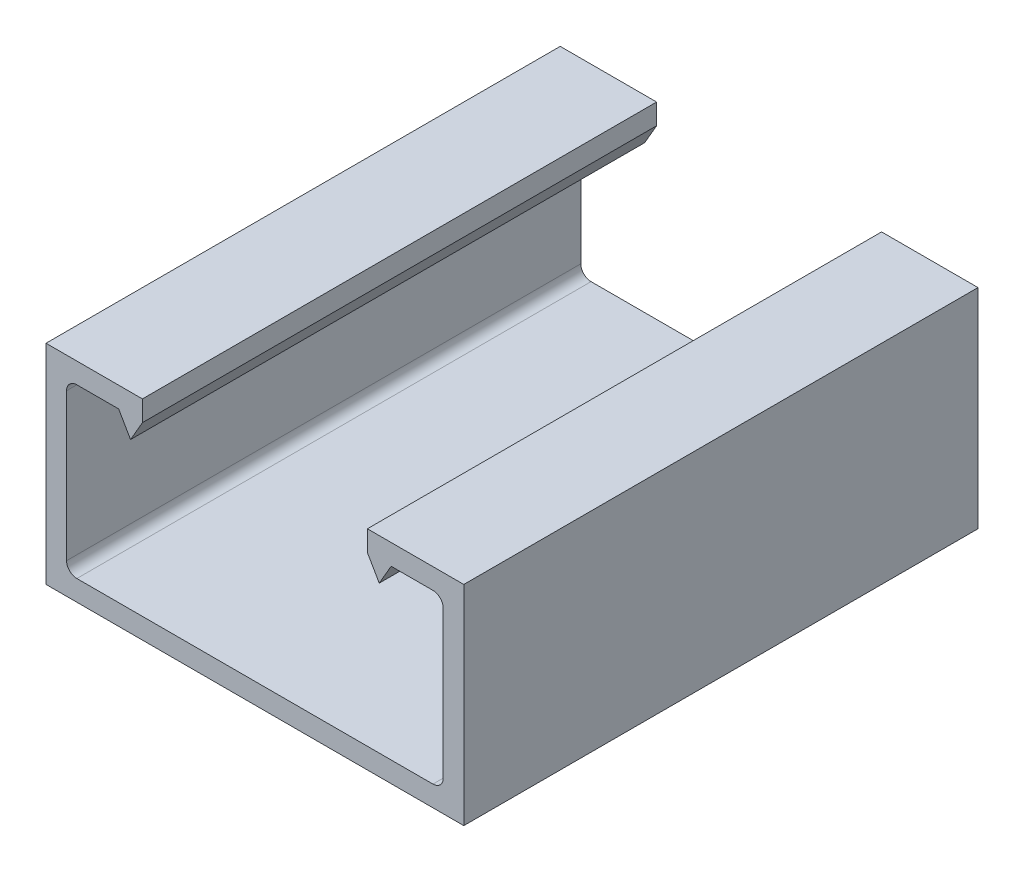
ISO-10303-21;
HEADER;
FILE_DESCRIPTION(('STEP AP214'),'2;1');
FILE_NAME('part.step','',(''),(''),'','','');
FILE_SCHEMA(('AUTOMOTIVE_DESIGN { 1 0 10303 214 1 1 1 1 }'));
ENDSEC;
DATA;
#1=APPLICATION_CONTEXT('core data for automotive mechanical design processes');
#2=APPLICATION_PROTOCOL_DEFINITION('international standard','automotive_design',2000,#1);
#3=PRODUCT_CONTEXT('',#1,'mechanical');
#4=PRODUCT('Part','Part','',(#3));
#5=PRODUCT_RELATED_PRODUCT_CATEGORY('part','',(#4));
#6=PRODUCT_DEFINITION_FORMATION('','',#4);
#7=PRODUCT_DEFINITION_CONTEXT('part definition',#1,'design');
#8=PRODUCT_DEFINITION('design','',#6,#7);
#9=PRODUCT_DEFINITION_SHAPE('','',#8);
#10=(LENGTH_UNIT() NAMED_UNIT(*) SI_UNIT(.MILLI.,.METRE.));
#11=(NAMED_UNIT(*) PLANE_ANGLE_UNIT() SI_UNIT($,.RADIAN.));
#12=(NAMED_UNIT(*) SI_UNIT($,.STERADIAN.) SOLID_ANGLE_UNIT());
#13=UNCERTAINTY_MEASURE_WITH_UNIT(LENGTH_MEASURE(1.E-05),#10,'distance_accuracy_value','');
#14=(GEOMETRIC_REPRESENTATION_CONTEXT(3) GLOBAL_UNCERTAINTY_ASSIGNED_CONTEXT((#13)) GLOBAL_UNIT_ASSIGNED_CONTEXT((#10,
#11,#12)) REPRESENTATION_CONTEXT('',''));
#15=CARTESIAN_POINT('',(0.,0.,0.));
#16=DIRECTION('',(0.,0.,1.));
#17=DIRECTION('',(1.,0.,0.));
#18=AXIS2_PLACEMENT_3D('',#15,#16,#17);
#19=CARTESIAN_POINT('',(-8.79475,-3.635375,12.7));
#20=DIRECTION('',(0.,0.,-1.));
#21=DIRECTION('',(-1.,0.,0.));
#22=AXIS2_PLACEMENT_3D('',#19,#20,#21);
#23=CYLINDRICAL_SURFACE('',#22,0.508);
#24=CARTESIAN_POINT('',(-8.79475,-3.635375,-12.7));
#25=DIRECTION('',(0.,0.,-1.));
#26=DIRECTION('',(1.,0.,0.));
#27=AXIS2_PLACEMENT_3D('',#24,#25,#26);
#28=CIRCLE('',#27,0.508);
#29=CARTESIAN_POINT('',(-8.79475,-4.143375,-12.7));
#30=VERTEX_POINT('',#29);
#31=CARTESIAN_POINT('',(-9.30275,-3.635375,-12.7));
#32=VERTEX_POINT('',#31);
#33=EDGE_CURVE('E210',#30,#32,#28,.T.);
#34=ORIENTED_EDGE('',*,*,#33,.T.);
#35=DIRECTION('',(0.,0.,-1.));
#36=VECTOR('',#35,1.);
#37=CARTESIAN_POINT('',(-9.30275,-3.635375,12.7));
#38=LINE('',#37,#36);
#39=CARTESIAN_POINT('',(-9.30275,-3.635375,12.7));
#40=VERTEX_POINT('',#39);
#41=EDGE_CURVE('E11',#40,#32,#38,.T.);
#42=ORIENTED_EDGE('',*,*,#41,.F.);
#43=CARTESIAN_POINT('',(-8.79475,-3.635375,12.7));
#44=DIRECTION('',(0.,0.,-1.));
#45=DIRECTION('',(1.,0.,0.));
#46=AXIS2_PLACEMENT_3D('',#43,#44,#45);
#47=CIRCLE('',#46,0.508);
#48=CARTESIAN_POINT('',(-8.79475,-4.143375,12.7));
#49=VERTEX_POINT('',#48);
#50=EDGE_CURVE('E244',#49,#40,#47,.T.);
#51=ORIENTED_EDGE('',*,*,#50,.F.);
#52=DIRECTION('',(0.,0.,-1.));
#53=VECTOR('',#52,1.);
#54=CARTESIAN_POINT('',(-8.79475,-4.143375,12.7));
#55=LINE('',#54,#53);
#56=EDGE_CURVE('E205',#49,#30,#55,.T.);
#57=ORIENTED_EDGE('',*,*,#56,.T.);
#58=EDGE_LOOP('',(#34,#42,#51,#57));
#59=FACE_BOUND('',#58,.T.);
#60=ADVANCED_FACE('F39',(#59),#23,.F.);
#61=CARTESIAN_POINT('',(-9.30275,3.635375,12.7));
#62=DIRECTION('',(-1.,0.,0.));
#63=DIRECTION('',(0.,-1.,0.));
#64=AXIS2_PLACEMENT_3D('',#61,#62,#63);
#65=PLANE('',#64);
#66=DIRECTION('',(0.,1.,0.));
#67=VECTOR('',#66,1.);
#68=CARTESIAN_POINT('',(-9.30275,3.635375,-12.7));
#69=LINE('',#68,#67);
#70=CARTESIAN_POINT('',(-9.30275,3.635375,-12.7));
#71=VERTEX_POINT('',#70);
#72=EDGE_CURVE('E208',#32,#71,#69,.T.);
#73=ORIENTED_EDGE('',*,*,#72,.T.);
#74=DIRECTION('',(0.,0.,-1.));
#75=VECTOR('',#74,1.);
#76=CARTESIAN_POINT('',(-9.30275,3.635375,12.7));
#77=LINE('',#76,#75);
#78=CARTESIAN_POINT('',(-9.30275,3.635375,12.7));
#79=VERTEX_POINT('',#78);
#80=EDGE_CURVE('E50',#79,#71,#77,.T.);
#81=ORIENTED_EDGE('',*,*,#80,.F.);
#82=DIRECTION('',(0.,1.,0.));
#83=VECTOR('',#82,1.);
#84=CARTESIAN_POINT('',(-9.30275,3.635375,12.7));
#85=LINE('',#84,#83);
#86=EDGE_CURVE('E135',#40,#79,#85,.T.);
#87=ORIENTED_EDGE('',*,*,#86,.F.);
#88=ORIENTED_EDGE('',*,*,#41,.T.);
#89=EDGE_LOOP('',(#73,#81,#87,#88));
#90=FACE_BOUND('',#89,.T.);
#91=ADVANCED_FACE('F361',(#90),#65,.F.);
#92=CARTESIAN_POINT('',(-8.79475,3.635375,12.7));
#93=DIRECTION('',(0.,0.,-1.));
#94=DIRECTION('',(-1.,0.,0.));
#95=AXIS2_PLACEMENT_3D('',#92,#93,#94);
#96=CYLINDRICAL_SURFACE('',#95,0.508000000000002);
#97=CARTESIAN_POINT('',(-8.79475,3.635375,-12.7));
#98=DIRECTION('',(0.,0.,-1.));
#99=DIRECTION('',(1.,0.,0.));
#100=AXIS2_PLACEMENT_3D('',#97,#98,#99);
#101=CIRCLE('',#100,0.508000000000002);
#102=CARTESIAN_POINT('',(-8.79475,4.143375,-12.7));
#103=VERTEX_POINT('',#102);
#104=EDGE_CURVE('E215',#71,#103,#101,.T.);
#105=ORIENTED_EDGE('',*,*,#104,.T.);
#106=DIRECTION('',(0.,0.,-1.));
#107=VECTOR('',#106,1.);
#108=CARTESIAN_POINT('',(-8.79475,4.143375,12.7));
#109=LINE('',#108,#107);
#110=CARTESIAN_POINT('',(-8.79475,4.143375,12.7));
#111=VERTEX_POINT('',#110);
#112=EDGE_CURVE('E290',#111,#103,#109,.T.);
#113=ORIENTED_EDGE('',*,*,#112,.F.);
#114=CARTESIAN_POINT('',(-8.79475,3.635375,12.7));
#115=DIRECTION('',(0.,0.,-1.));
#116=DIRECTION('',(1.,0.,0.));
#117=AXIS2_PLACEMENT_3D('',#114,#115,#116);
#118=CIRCLE('',#117,0.508000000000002);
#119=EDGE_CURVE('E298',#79,#111,#118,.T.);
#120=ORIENTED_EDGE('',*,*,#119,.F.);
#121=ORIENTED_EDGE('',*,*,#80,.T.);
#122=EDGE_LOOP('',(#105,#113,#120,#121));
#123=FACE_BOUND('',#122,.T.);
#124=ADVANCED_FACE('F295',(#123),#96,.F.);
#125=CARTESIAN_POINT('',(-6.72942574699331,4.143375,12.7));
#126=DIRECTION('',(0.,1.,0.));
#127=DIRECTION('',(0.,0.,1.));
#128=AXIS2_PLACEMENT_3D('',#125,#126,#127);
#129=PLANE('',#128);
#130=DIRECTION('',(1.,0.,0.));
#131=VECTOR('',#130,1.);
#132=CARTESIAN_POINT('',(-6.72942574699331,4.143375,-12.7));
#133=LINE('',#132,#131);
#134=CARTESIAN_POINT('',(-6.72942574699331,4.143375,-12.7));
#135=VERTEX_POINT('',#134);
#136=EDGE_CURVE('E211',#103,#135,#133,.T.);
#137=ORIENTED_EDGE('',*,*,#136,.T.);
#138=DIRECTION('',(0.,0.,-1.));
#139=VECTOR('',#138,1.);
#140=CARTESIAN_POINT('',(-6.72942574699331,4.143375,12.7));
#141=LINE('',#140,#139);
#142=CARTESIAN_POINT('',(-6.72942574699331,4.143375,12.7));
#143=VERTEX_POINT('',#142);
#144=EDGE_CURVE('E281',#143,#135,#141,.T.);
#145=ORIENTED_EDGE('',*,*,#144,.F.);
#146=DIRECTION('',(1.,0.,0.));
#147=VECTOR('',#146,1.);
#148=CARTESIAN_POINT('',(-6.72942574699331,4.143375,12.7));
#149=LINE('',#148,#147);
#150=EDGE_CURVE('E313',#111,#143,#149,.T.);
#151=ORIENTED_EDGE('',*,*,#150,.F.);
#152=ORIENTED_EDGE('',*,*,#112,.T.);
#153=EDGE_LOOP('',(#137,#145,#151,#152));
#154=FACE_BOUND('',#153,.T.);
#155=ADVANCED_FACE('F304',(#154),#129,.F.);
#156=CARTESIAN_POINT('',(-6.72942574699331,4.143375,12.7));
#157=DIRECTION('',(0.866025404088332,0.499999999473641,0.));
#158=DIRECTION('',(-0.499999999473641,0.866025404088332,0.));
#159=AXIS2_PLACEMENT_3D('',#156,#157,#158);
#160=PLANE('',#159);
#161=DIRECTION('',(0.499999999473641,-0.866025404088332,0.));
#162=VECTOR('',#161,1.);
#163=CARTESIAN_POINT('',(-6.72942574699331,4.143375,-12.7));
#164=LINE('',#163,#162);
#165=CARTESIAN_POINT('',(-6.14283787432,3.127375,-12.7));
#166=VERTEX_POINT('',#165);
#167=EDGE_CURVE('E218',#135,#166,#164,.T.);
#168=ORIENTED_EDGE('',*,*,#167,.T.);
#169=DIRECTION('',(0.,0.,-1.));
#170=VECTOR('',#169,1.);
#171=CARTESIAN_POINT('',(-6.14283787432,3.127375,12.7));
#172=LINE('',#171,#170);
#173=CARTESIAN_POINT('',(-6.14283787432,3.127375,12.7));
#174=VERTEX_POINT('',#173);
#175=EDGE_CURVE('E284',#174,#166,#172,.T.);
#176=ORIENTED_EDGE('',*,*,#175,.F.);
#177=DIRECTION('',(0.499999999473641,-0.866025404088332,0.));
#178=VECTOR('',#177,1.);
#179=CARTESIAN_POINT('',(-6.72942574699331,4.143375,12.7));
#180=LINE('',#179,#178);
#181=EDGE_CURVE('E311',#143,#174,#180,.T.);
#182=ORIENTED_EDGE('',*,*,#181,.F.);
#183=ORIENTED_EDGE('',*,*,#144,.T.);
#184=EDGE_LOOP('',(#168,#176,#182,#183));
#185=FACE_BOUND('',#184,.T.);
#186=ADVANCED_FACE('F307',(#185),#160,.F.);
#187=CARTESIAN_POINT('',(-6.14283787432,3.127375,12.7));
#188=DIRECTION('',(-0.866025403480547,0.500000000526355,0.));
#189=DIRECTION('',(-0.500000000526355,-0.866025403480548,0.));
#190=AXIS2_PLACEMENT_3D('',#187,#188,#189);
#191=PLANE('',#190);
#192=DIRECTION('',(0.500000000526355,0.866025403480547,0.));
#193=VECTOR('',#192,1.);
#194=CARTESIAN_POINT('',(-6.14283787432,3.127375,-12.7));
#195=LINE('',#194,#193);
#196=CARTESIAN_POINT('',(-5.55625,4.143375,-12.7));
#197=VERTEX_POINT('',#196);
#198=EDGE_CURVE('E217',#166,#197,#195,.T.);
#199=ORIENTED_EDGE('',*,*,#198,.T.);
#200=DIRECTION('',(0.,0.,-1.));
#201=VECTOR('',#200,1.);
#202=CARTESIAN_POINT('',(-5.55625,4.143375,12.7));
#203=LINE('',#202,#201);
#204=CARTESIAN_POINT('',(-5.55625,4.143375,12.7));
#205=VERTEX_POINT('',#204);
#206=EDGE_CURVE('E276',#205,#197,#203,.T.);
#207=ORIENTED_EDGE('',*,*,#206,.F.);
#208=DIRECTION('',(0.500000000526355,0.866025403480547,0.));
#209=VECTOR('',#208,1.);
#210=CARTESIAN_POINT('',(-6.14283787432,3.127375,12.7));
#211=LINE('',#210,#209);
#212=EDGE_CURVE('E312',#174,#205,#211,.T.);
#213=ORIENTED_EDGE('',*,*,#212,.F.);
#214=ORIENTED_EDGE('',*,*,#175,.T.);
#215=EDGE_LOOP('',(#199,#207,#213,#214));
#216=FACE_BOUND('',#215,.T.);
#217=ADVANCED_FACE('F376',(#216),#191,.F.);
#218=CARTESIAN_POINT('',(-5.55625,4.143375,12.7));
#219=DIRECTION('',(-1.,0.,0.));
#220=DIRECTION('',(0.,0.,1.));
#221=AXIS2_PLACEMENT_3D('',#218,#219,#220);
#222=PLANE('',#221);
#223=DIRECTION('',(0.,1.,0.));
#224=VECTOR('',#223,1.);
#225=CARTESIAN_POINT('',(-5.55625,4.143375,-12.7));
#226=LINE('',#225,#224);
#227=CARTESIAN_POINT('',(-5.55625,5.159375,-12.7));
#228=VERTEX_POINT('',#227);
#229=EDGE_CURVE('E216',#197,#228,#226,.T.);
#230=ORIENTED_EDGE('',*,*,#229,.T.);
#231=DIRECTION('',(0.,0.,-1.));
#232=VECTOR('',#231,1.);
#233=CARTESIAN_POINT('',(-5.55625,5.159375,12.7));
#234=LINE('',#233,#232);
#235=CARTESIAN_POINT('',(-5.55625,5.159375,12.7));
#236=VERTEX_POINT('',#235);
#237=EDGE_CURVE('E277',#236,#228,#234,.T.);
#238=ORIENTED_EDGE('',*,*,#237,.F.);
#239=DIRECTION('',(0.,1.,0.));
#240=VECTOR('',#239,1.);
#241=CARTESIAN_POINT('',(-5.55625,4.143375,12.7));
#242=LINE('',#241,#240);
#243=EDGE_CURVE('E317',#205,#236,#242,.T.);
#244=ORIENTED_EDGE('',*,*,#243,.F.);
#245=ORIENTED_EDGE('',*,*,#206,.T.);
#246=EDGE_LOOP('',(#230,#238,#244,#245));
#247=FACE_BOUND('',#246,.T.);
#248=ADVANCED_FACE('F378',(#247),#222,.F.);
#249=CARTESIAN_POINT('',(-5.55625,5.159375,12.7));
#250=DIRECTION('',(0.,-1.,0.));
#251=DIRECTION('',(1.,0.,0.));
#252=AXIS2_PLACEMENT_3D('',#249,#250,#251);
#253=PLANE('',#252);
#254=DIRECTION('',(-1.,0.,0.));
#255=VECTOR('',#254,1.);
#256=CARTESIAN_POINT('',(-5.55625,5.159375,-12.7));
#257=LINE('',#256,#255);
#258=CARTESIAN_POINT('',(-10.31875,5.159375,-12.7));
#259=VERTEX_POINT('',#258);
#260=EDGE_CURVE('E224',#228,#259,#257,.T.);
#261=ORIENTED_EDGE('',*,*,#260,.T.);
#262=DIRECTION('',(0.,0.,-1.));
#263=VECTOR('',#262,1.);
#264=CARTESIAN_POINT('',(-10.31875,5.159375,12.7));
#265=LINE('',#264,#263);
#266=CARTESIAN_POINT('',(-10.31875,5.159375,12.7));
#267=VERTEX_POINT('',#266);
#268=EDGE_CURVE('E271',#267,#259,#265,.T.);
#269=ORIENTED_EDGE('',*,*,#268,.F.);
#270=DIRECTION('',(-1.,0.,0.));
#271=VECTOR('',#270,1.);
#272=CARTESIAN_POINT('',(-5.55625,5.159375,12.7));
#273=LINE('',#272,#271);
#274=EDGE_CURVE('E325',#236,#267,#273,.T.);
#275=ORIENTED_EDGE('',*,*,#274,.F.);
#276=ORIENTED_EDGE('',*,*,#237,.T.);
#277=EDGE_LOOP('',(#261,#269,#275,#276));
#278=FACE_BOUND('',#277,.T.);
#279=ADVANCED_FACE('F384',(#278),#253,.F.);
#280=CARTESIAN_POINT('',(-10.31875,5.159375,12.7));
#281=DIRECTION('',(1.,0.,0.));
#282=DIRECTION('',(0.,0.,-1.));
#283=AXIS2_PLACEMENT_3D('',#280,#281,#282);
#284=PLANE('',#283);
#285=DIRECTION('',(0.,-1.,0.));
#286=VECTOR('',#285,1.);
#287=CARTESIAN_POINT('',(-10.31875,5.159375,-12.7));
#288=LINE('',#287,#286);
#289=CARTESIAN_POINT('',(-10.31875,-5.159375,-12.7));
#290=VERTEX_POINT('',#289);
#291=EDGE_CURVE('E221',#259,#290,#288,.T.);
#292=ORIENTED_EDGE('',*,*,#291,.T.);
#293=DIRECTION('',(0.,0.,-1.));
#294=VECTOR('',#293,1.);
#295=CARTESIAN_POINT('',(-10.31875,-5.159375,12.7));
#296=LINE('',#295,#294);
#297=CARTESIAN_POINT('',(-10.31875,-5.159375,12.7));
#298=VERTEX_POINT('',#297);
#299=EDGE_CURVE('E268',#298,#290,#296,.T.);
#300=ORIENTED_EDGE('',*,*,#299,.F.);
#301=DIRECTION('',(0.,-1.,0.));
#302=VECTOR('',#301,1.);
#303=CARTESIAN_POINT('',(-10.31875,5.159375,12.7));
#304=LINE('',#303,#302);
#305=EDGE_CURVE('E321',#267,#298,#304,.T.);
#306=ORIENTED_EDGE('',*,*,#305,.F.);
#307=ORIENTED_EDGE('',*,*,#268,.T.);
#308=EDGE_LOOP('',(#292,#300,#306,#307));
#309=FACE_BOUND('',#308,.T.);
#310=ADVANCED_FACE('F390',(#309),#284,.F.);
#311=CARTESIAN_POINT('',(-10.31875,-5.159375,12.7));
#312=DIRECTION('',(0.,1.,0.));
#313=DIRECTION('',(0.,0.,1.));
#314=AXIS2_PLACEMENT_3D('',#311,#312,#313);
#315=PLANE('',#314);
#316=DIRECTION('',(1.,0.,0.));
#317=VECTOR('',#316,1.);
#318=CARTESIAN_POINT('',(-10.31875,-5.159375,-12.7));
#319=LINE('',#318,#317);
#320=CARTESIAN_POINT('',(10.31875,-5.159375,-12.7));
#321=VERTEX_POINT('',#320);
#322=EDGE_CURVE('E228',#290,#321,#319,.T.);
#323=ORIENTED_EDGE('',*,*,#322,.T.);
#324=DIRECTION('',(0.,0.,-1.));
#325=VECTOR('',#324,1.);
#326=CARTESIAN_POINT('',(10.31875,-5.159375,12.7));
#327=LINE('',#326,#325);
#328=CARTESIAN_POINT('',(10.31875,-5.159375,12.7));
#329=VERTEX_POINT('',#328);
#330=EDGE_CURVE('E269',#329,#321,#327,.T.);
#331=ORIENTED_EDGE('',*,*,#330,.F.);
#332=DIRECTION('',(1.,0.,0.));
#333=VECTOR('',#332,1.);
#334=CARTESIAN_POINT('',(-10.31875,-5.159375,12.7));
#335=LINE('',#334,#333);
#336=EDGE_CURVE('E328',#298,#329,#335,.T.);
#337=ORIENTED_EDGE('',*,*,#336,.F.);
#338=ORIENTED_EDGE('',*,*,#299,.T.);
#339=EDGE_LOOP('',(#323,#331,#337,#338));
#340=FACE_BOUND('',#339,.T.);
#341=ADVANCED_FACE('F393',(#340),#315,.F.);
#342=CARTESIAN_POINT('',(10.31875,-5.159375,12.7));
#343=DIRECTION('',(-1.,0.,0.));
#344=DIRECTION('',(0.,-1.,0.));
#345=AXIS2_PLACEMENT_3D('',#342,#343,#344);
#346=PLANE('',#345);
#347=DIRECTION('',(0.,1.,0.));
#348=VECTOR('',#347,1.);
#349=CARTESIAN_POINT('',(10.31875,-5.159375,-12.7));
#350=LINE('',#349,#348);
#351=CARTESIAN_POINT('',(10.31875,5.159375,-12.7));
#352=VERTEX_POINT('',#351);
#353=EDGE_CURVE('E226',#321,#352,#350,.T.);
#354=ORIENTED_EDGE('',*,*,#353,.T.);
#355=DIRECTION('',(0.,0.,-1.));
#356=VECTOR('',#355,1.);
#357=CARTESIAN_POINT('',(10.31875,5.159375,12.7));
#358=LINE('',#357,#356);
#359=CARTESIAN_POINT('',(10.31875,5.159375,12.7));
#360=VERTEX_POINT('',#359);
#361=EDGE_CURVE('E265',#360,#352,#358,.T.);
#362=ORIENTED_EDGE('',*,*,#361,.F.);
#363=DIRECTION('',(0.,1.,0.));
#364=VECTOR('',#363,1.);
#365=CARTESIAN_POINT('',(10.31875,-5.159375,12.7));
#366=LINE('',#365,#364);
#367=EDGE_CURVE('E327',#329,#360,#366,.T.);
#368=ORIENTED_EDGE('',*,*,#367,.F.);
#369=ORIENTED_EDGE('',*,*,#330,.T.);
#370=EDGE_LOOP('',(#354,#362,#368,#369));
#371=FACE_BOUND('',#370,.T.);
#372=ADVANCED_FACE('F391',(#371),#346,.F.);
#373=CARTESIAN_POINT('',(10.31875,5.159375,12.7));
#374=DIRECTION('',(0.,-1.,0.));
#375=DIRECTION('',(1.,0.,0.));
#376=AXIS2_PLACEMENT_3D('',#373,#374,#375);
#377=PLANE('',#376);
#378=DIRECTION('',(-1.,0.,0.));
#379=VECTOR('',#378,1.);
#380=CARTESIAN_POINT('',(10.31875,5.159375,-12.7));
#381=LINE('',#380,#379);
#382=CARTESIAN_POINT('',(5.55625,5.159375,-12.7));
#383=VERTEX_POINT('',#382);
#384=EDGE_CURVE('E229',#352,#383,#381,.T.);
#385=ORIENTED_EDGE('',*,*,#384,.T.);
#386=DIRECTION('',(0.,0.,-1.));
#387=VECTOR('',#386,1.);
#388=CARTESIAN_POINT('',(5.55625,5.159375,12.7));
#389=LINE('',#388,#387);
#390=CARTESIAN_POINT('',(5.55625,5.159375,12.7));
#391=VERTEX_POINT('',#390);
#392=EDGE_CURVE('E263',#391,#383,#389,.T.);
#393=ORIENTED_EDGE('',*,*,#392,.F.);
#394=DIRECTION('',(-1.,0.,0.));
#395=VECTOR('',#394,1.);
#396=CARTESIAN_POINT('',(10.31875,5.159375,12.7));
#397=LINE('',#396,#395);
#398=EDGE_CURVE('E326',#360,#391,#397,.T.);
#399=ORIENTED_EDGE('',*,*,#398,.F.);
#400=ORIENTED_EDGE('',*,*,#361,.T.);
#401=EDGE_LOOP('',(#385,#393,#399,#400));
#402=FACE_BOUND('',#401,.T.);
#403=ADVANCED_FACE('F396',(#402),#377,.F.);
#404=CARTESIAN_POINT('',(5.55625,4.143375,12.7));
#405=DIRECTION('',(1.,0.,0.));
#406=DIRECTION('',(0.,1.,0.));
#407=AXIS2_PLACEMENT_3D('',#404,#405,#406);
#408=PLANE('',#407);
#409=DIRECTION('',(0.,-1.,0.));
#410=VECTOR('',#409,1.);
#411=CARTESIAN_POINT('',(5.55625,4.143375,-12.7));
#412=LINE('',#411,#410);
#413=CARTESIAN_POINT('',(5.55625,4.143375,-12.7));
#414=VERTEX_POINT('',#413);
#415=EDGE_CURVE('E235',#383,#414,#412,.T.);
#416=ORIENTED_EDGE('',*,*,#415,.T.);
#417=DIRECTION('',(0.,0.,-1.));
#418=VECTOR('',#417,1.);
#419=CARTESIAN_POINT('',(5.55625,4.143375,12.7));
#420=LINE('',#419,#418);
#421=CARTESIAN_POINT('',(5.55625,4.143375,12.7));
#422=VERTEX_POINT('',#421);
#423=EDGE_CURVE('E259',#422,#414,#420,.T.);
#424=ORIENTED_EDGE('',*,*,#423,.F.);
#425=DIRECTION('',(0.,-1.,0.));
#426=VECTOR('',#425,1.);
#427=CARTESIAN_POINT('',(5.55625,4.143375,12.7));
#428=LINE('',#427,#426);
#429=EDGE_CURVE('E334',#391,#422,#428,.T.);
#430=ORIENTED_EDGE('',*,*,#429,.F.);
#431=ORIENTED_EDGE('',*,*,#392,.T.);
#432=EDGE_LOOP('',(#416,#424,#430,#431));
#433=FACE_BOUND('',#432,.T.);
#434=ADVANCED_FACE('F401',(#433),#408,.F.);
#435=CARTESIAN_POINT('',(6.14283787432,3.127375,12.7));
#436=DIRECTION('',(0.866025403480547,0.500000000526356,0.));
#437=DIRECTION('',(-0.500000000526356,0.866025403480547,0.));
#438=AXIS2_PLACEMENT_3D('',#435,#436,#437);
#439=PLANE('',#438);
#440=DIRECTION('',(0.500000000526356,-0.866025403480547,0.));
#441=VECTOR('',#440,1.);
#442=CARTESIAN_POINT('',(6.14283787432,3.127375,-12.7));
#443=LINE('',#442,#441);
#444=CARTESIAN_POINT('',(6.14283787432,3.127375,-12.7));
#445=VERTEX_POINT('',#444);
#446=EDGE_CURVE('E234',#414,#445,#443,.T.);
#447=ORIENTED_EDGE('',*,*,#446,.T.);
#448=DIRECTION('',(0.,0.,-1.));
#449=VECTOR('',#448,1.);
#450=CARTESIAN_POINT('',(6.14283787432,3.127375,12.7));
#451=LINE('',#450,#449);
#452=CARTESIAN_POINT('',(6.14283787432,3.127375,12.7));
#453=VERTEX_POINT('',#452);
#454=EDGE_CURVE('E253',#453,#445,#451,.T.);
#455=ORIENTED_EDGE('',*,*,#454,.F.);
#456=DIRECTION('',(0.500000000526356,-0.866025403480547,0.));
#457=VECTOR('',#456,1.);
#458=CARTESIAN_POINT('',(6.14283787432,3.127375,12.7));
#459=LINE('',#458,#457);
#460=EDGE_CURVE('E331',#422,#453,#459,.T.);
#461=ORIENTED_EDGE('',*,*,#460,.F.);
#462=ORIENTED_EDGE('',*,*,#423,.T.);
#463=EDGE_LOOP('',(#447,#455,#461,#462));
#464=FACE_BOUND('',#463,.T.);
#465=ADVANCED_FACE('F410',(#464),#439,.F.);
#466=CARTESIAN_POINT('',(6.72942574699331,4.143375,12.7));
#467=DIRECTION('',(-0.866025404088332,0.499999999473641,0.));
#468=DIRECTION('',(-0.499999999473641,-0.866025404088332,0.));
#469=AXIS2_PLACEMENT_3D('',#466,#467,#468);
#470=PLANE('',#469);
#471=DIRECTION('',(0.499999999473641,0.866025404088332,0.));
#472=VECTOR('',#471,1.);
#473=CARTESIAN_POINT('',(6.72942574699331,4.143375,-12.7));
#474=LINE('',#473,#472);
#475=CARTESIAN_POINT('',(6.72942574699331,4.143375,-12.7));
#476=VERTEX_POINT('',#475);
#477=EDGE_CURVE('E236',#445,#476,#474,.T.);
#478=ORIENTED_EDGE('',*,*,#477,.T.);
#479=DIRECTION('',(0.,0.,-1.));
#480=VECTOR('',#479,1.);
#481=CARTESIAN_POINT('',(6.72942574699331,4.143375,12.7));
#482=LINE('',#481,#480);
#483=CARTESIAN_POINT('',(6.72942574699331,4.143375,12.7));
#484=VERTEX_POINT('',#483);
#485=EDGE_CURVE('E255',#484,#476,#482,.T.);
#486=ORIENTED_EDGE('',*,*,#485,.F.);
#487=DIRECTION('',(0.499999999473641,0.866025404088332,0.));
#488=VECTOR('',#487,1.);
#489=CARTESIAN_POINT('',(6.72942574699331,4.143375,12.7));
#490=LINE('',#489,#488);
#491=EDGE_CURVE('E337',#453,#484,#490,.T.);
#492=ORIENTED_EDGE('',*,*,#491,.F.);
#493=ORIENTED_EDGE('',*,*,#454,.T.);
#494=EDGE_LOOP('',(#478,#486,#492,#493));
#495=FACE_BOUND('',#494,.T.);
#496=ADVANCED_FACE('F413',(#495),#470,.F.);
#497=CARTESIAN_POINT('',(8.79475,4.143375,12.7));
#498=DIRECTION('',(0.,1.,0.));
#499=DIRECTION('',(0.,0.,1.));
#500=AXIS2_PLACEMENT_3D('',#497,#498,#499);
#501=PLANE('',#500);
#502=DIRECTION('',(1.,0.,0.));
#503=VECTOR('',#502,1.);
#504=CARTESIAN_POINT('',(8.79475,4.143375,-12.7));
#505=LINE('',#504,#503);
#506=CARTESIAN_POINT('',(8.79475,4.143375,-12.7));
#507=VERTEX_POINT('',#506);
#508=EDGE_CURVE('E238',#476,#507,#505,.T.);
#509=ORIENTED_EDGE('',*,*,#508,.T.);
#510=DIRECTION('',(0.,0.,-1.));
#511=VECTOR('',#510,1.);
#512=CARTESIAN_POINT('',(8.79475,4.143375,12.7));
#513=LINE('',#512,#511);
#514=CARTESIAN_POINT('',(8.79475,4.143375,12.7));
#515=VERTEX_POINT('',#514);
#516=EDGE_CURVE('E248',#515,#507,#513,.T.);
#517=ORIENTED_EDGE('',*,*,#516,.F.);
#518=DIRECTION('',(1.,0.,0.));
#519=VECTOR('',#518,1.);
#520=CARTESIAN_POINT('',(8.79475,4.143375,12.7));
#521=LINE('',#520,#519);
#522=EDGE_CURVE('E336',#484,#515,#521,.T.);
#523=ORIENTED_EDGE('',*,*,#522,.F.);
#524=ORIENTED_EDGE('',*,*,#485,.T.);
#525=EDGE_LOOP('',(#509,#517,#523,#524));
#526=FACE_BOUND('',#525,.T.);
#527=ADVANCED_FACE('F341',(#526),#501,.F.);
#528=CARTESIAN_POINT('',(8.79475,3.635375,12.7));
#529=DIRECTION('',(0.,0.,-1.));
#530=DIRECTION('',(-1.,0.,0.));
#531=AXIS2_PLACEMENT_3D('',#528,#529,#530);
#532=CYLINDRICAL_SURFACE('',#531,0.508);
#533=CARTESIAN_POINT('',(8.79475,3.635375,-12.7));
#534=DIRECTION('',(0.,0.,-1.));
#535=DIRECTION('',(1.,0.,0.));
#536=AXIS2_PLACEMENT_3D('',#533,#534,#535);
#537=CIRCLE('',#536,0.508);
#538=CARTESIAN_POINT('',(9.30275,3.635375,-12.7));
#539=VERTEX_POINT('',#538);
#540=EDGE_CURVE('E239',#507,#539,#537,.T.);
#541=ORIENTED_EDGE('',*,*,#540,.T.);
#542=DIRECTION('',(0.,0.,-1.));
#543=VECTOR('',#542,1.);
#544=CARTESIAN_POINT('',(9.30275,3.635375,12.7));
#545=LINE('',#544,#543);
#546=CARTESIAN_POINT('',(9.30275,3.635375,12.7));
#547=VERTEX_POINT('',#546);
#548=EDGE_CURVE('E197',#547,#539,#545,.T.);
#549=ORIENTED_EDGE('',*,*,#548,.F.);
#550=CARTESIAN_POINT('',(8.79475,3.635375,12.7));
#551=DIRECTION('',(0.,0.,-1.));
#552=DIRECTION('',(1.,0.,0.));
#553=AXIS2_PLACEMENT_3D('',#550,#551,#552);
#554=CIRCLE('',#553,0.508);
#555=EDGE_CURVE('E186',#515,#547,#554,.T.);
#556=ORIENTED_EDGE('',*,*,#555,.F.);
#557=ORIENTED_EDGE('',*,*,#516,.T.);
#558=EDGE_LOOP('',(#541,#549,#556,#557));
#559=FACE_BOUND('',#558,.T.);
#560=ADVANCED_FACE('F347',(#559),#532,.F.);
#561=CARTESIAN_POINT('',(9.30275,-3.635375,12.7));
#562=DIRECTION('',(1.,0.,0.));
#563=DIRECTION('',(0.,1.,0.));
#564=AXIS2_PLACEMENT_3D('',#561,#562,#563);
#565=PLANE('',#564);
#566=DIRECTION('',(0.,-1.,0.));
#567=VECTOR('',#566,1.);
#568=CARTESIAN_POINT('',(9.30275,-3.635375,-12.7));
#569=LINE('',#568,#567);
#570=CARTESIAN_POINT('',(9.30275,-3.635375,-12.7));
#571=VERTEX_POINT('',#570);
#572=EDGE_CURVE('E199',#539,#571,#569,.T.);
#573=ORIENTED_EDGE('',*,*,#572,.T.);
#574=DIRECTION('',(0.,0.,-1.));
#575=VECTOR('',#574,1.);
#576=CARTESIAN_POINT('',(9.30275,-3.635375,12.7));
#577=LINE('',#576,#575);
#578=CARTESIAN_POINT('',(9.30275,-3.635375,12.7));
#579=VERTEX_POINT('',#578);
#580=EDGE_CURVE('E191',#579,#571,#577,.T.);
#581=ORIENTED_EDGE('',*,*,#580,.F.);
#582=DIRECTION('',(0.,-1.,0.));
#583=VECTOR('',#582,1.);
#584=CARTESIAN_POINT('',(9.30275,-3.635375,12.7));
#585=LINE('',#584,#583);
#586=EDGE_CURVE('E182',#547,#579,#585,.T.);
#587=ORIENTED_EDGE('',*,*,#586,.F.);
#588=ORIENTED_EDGE('',*,*,#548,.T.);
#589=EDGE_LOOP('',(#573,#581,#587,#588));
#590=FACE_BOUND('',#589,.T.);
#591=ADVANCED_FACE('F193',(#590),#565,.F.);
#592=CARTESIAN_POINT('',(8.79475,-3.635375,12.7));
#593=DIRECTION('',(0.,0.,-1.));
#594=DIRECTION('',(-1.,0.,0.));
#595=AXIS2_PLACEMENT_3D('',#592,#593,#594);
#596=CYLINDRICAL_SURFACE('',#595,0.508000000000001);
#597=CARTESIAN_POINT('',(8.79475,-3.635375,-12.7));
#598=DIRECTION('',(0.,0.,-1.));
#599=DIRECTION('',(1.,0.,0.));
#600=AXIS2_PLACEMENT_3D('',#597,#598,#599);
#601=CIRCLE('',#600,0.508000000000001);
#602=CARTESIAN_POINT('',(8.79475,-4.143375,-12.7));
#603=VERTEX_POINT('',#602);
#604=EDGE_CURVE('E119',#571,#603,#601,.T.);
#605=ORIENTED_EDGE('',*,*,#604,.T.);
#606=DIRECTION('',(0.,0.,-1.));
#607=VECTOR('',#606,1.);
#608=CARTESIAN_POINT('',(8.79475,-4.143375,12.7));
#609=LINE('',#608,#607);
#610=CARTESIAN_POINT('',(8.79475,-4.143375,12.7));
#611=VERTEX_POINT('',#610);
#612=EDGE_CURVE('E200',#611,#603,#609,.T.);
#613=ORIENTED_EDGE('',*,*,#612,.F.);
#614=CARTESIAN_POINT('',(8.79475,-3.635375,12.7));
#615=DIRECTION('',(0.,0.,-1.));
#616=DIRECTION('',(1.,0.,0.));
#617=AXIS2_PLACEMENT_3D('',#614,#615,#616);
#618=CIRCLE('',#617,0.508000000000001);
#619=EDGE_CURVE('E190',#579,#611,#618,.T.);
#620=ORIENTED_EDGE('',*,*,#619,.F.);
#621=ORIENTED_EDGE('',*,*,#580,.T.);
#622=EDGE_LOOP('',(#605,#613,#620,#621));
#623=FACE_BOUND('',#622,.T.);
#624=ADVANCED_FACE('F202',(#623),#596,.F.);
#625=CARTESIAN_POINT('',(-8.79475,-4.143375,12.7));
#626=DIRECTION('',(0.,-1.,0.));
#627=DIRECTION('',(1.,0.,0.));
#628=AXIS2_PLACEMENT_3D('',#625,#626,#627);
#629=PLANE('',#628);
#630=DIRECTION('',(-1.,0.,0.));
#631=VECTOR('',#630,1.);
#632=CARTESIAN_POINT('',(-8.79475,-4.143375,-12.7));
#633=LINE('',#632,#631);
#634=EDGE_CURVE('E127',#603,#30,#633,.T.);
#635=ORIENTED_EDGE('',*,*,#634,.T.);
#636=ORIENTED_EDGE('',*,*,#56,.F.);
#637=DIRECTION('',(-1.,0.,0.));
#638=VECTOR('',#637,1.);
#639=CARTESIAN_POINT('',(-8.79475,-4.143375,12.7));
#640=LINE('',#639,#638);
#641=EDGE_CURVE('E54',#611,#49,#640,.T.);
#642=ORIENTED_EDGE('',*,*,#641,.F.);
#643=ORIENTED_EDGE('',*,*,#612,.T.);
#644=EDGE_LOOP('',(#635,#636,#642,#643));
#645=FACE_BOUND('',#644,.T.);
#646=ADVANCED_FACE('F354',(#645),#629,.F.);
#647=CARTESIAN_POINT('',(-8.79475,-3.635375,12.7));
#648=DIRECTION('',(0.,0.,1.));
#649=DIRECTION('',(1.,0.,0.));
#650=AXIS2_PLACEMENT_3D('',#647,#648,#649);
#651=PLANE('',#650);
#652=ORIENTED_EDGE('',*,*,#50,.T.);
#653=ORIENTED_EDGE('',*,*,#86,.T.);
#654=ORIENTED_EDGE('',*,*,#119,.T.);
#655=ORIENTED_EDGE('',*,*,#150,.T.);
#656=ORIENTED_EDGE('',*,*,#181,.T.);
#657=ORIENTED_EDGE('',*,*,#212,.T.);
#658=ORIENTED_EDGE('',*,*,#243,.T.);
#659=ORIENTED_EDGE('',*,*,#274,.T.);
#660=ORIENTED_EDGE('',*,*,#305,.T.);
#661=ORIENTED_EDGE('',*,*,#336,.T.);
#662=ORIENTED_EDGE('',*,*,#367,.T.);
#663=ORIENTED_EDGE('',*,*,#398,.T.);
#664=ORIENTED_EDGE('',*,*,#429,.T.);
#665=ORIENTED_EDGE('',*,*,#460,.T.);
#666=ORIENTED_EDGE('',*,*,#491,.T.);
#667=ORIENTED_EDGE('',*,*,#522,.T.);
#668=ORIENTED_EDGE('',*,*,#555,.T.);
#669=ORIENTED_EDGE('',*,*,#586,.T.);
#670=ORIENTED_EDGE('',*,*,#619,.T.);
#671=ORIENTED_EDGE('',*,*,#641,.T.);
#672=EDGE_LOOP('',(#652,#653,#654,#655,#656,#657,#658,#659,#660,#661,#662,#663,#664,#665,#666,
#667,#668,#669,#670,#671));
#673=FACE_BOUND('',#672,.T.);
#674=ADVANCED_FACE('F184',(#673),#651,.T.);
#675=CARTESIAN_POINT('',(-8.79475,-3.635375,-12.7));
#676=DIRECTION('',(0.,0.,1.));
#677=DIRECTION('',(1.,0.,0.));
#678=AXIS2_PLACEMENT_3D('',#675,#676,#677);
#679=PLANE('',#678);
#680=ORIENTED_EDGE('',*,*,#33,.F.);
#681=ORIENTED_EDGE('',*,*,#634,.F.);
#682=ORIENTED_EDGE('',*,*,#604,.F.);
#683=ORIENTED_EDGE('',*,*,#572,.F.);
#684=ORIENTED_EDGE('',*,*,#540,.F.);
#685=ORIENTED_EDGE('',*,*,#508,.F.);
#686=ORIENTED_EDGE('',*,*,#477,.F.);
#687=ORIENTED_EDGE('',*,*,#446,.F.);
#688=ORIENTED_EDGE('',*,*,#415,.F.);
#689=ORIENTED_EDGE('',*,*,#384,.F.);
#690=ORIENTED_EDGE('',*,*,#353,.F.);
#691=ORIENTED_EDGE('',*,*,#322,.F.);
#692=ORIENTED_EDGE('',*,*,#291,.F.);
#693=ORIENTED_EDGE('',*,*,#260,.F.);
#694=ORIENTED_EDGE('',*,*,#229,.F.);
#695=ORIENTED_EDGE('',*,*,#198,.F.);
#696=ORIENTED_EDGE('',*,*,#167,.F.);
#697=ORIENTED_EDGE('',*,*,#136,.F.);
#698=ORIENTED_EDGE('',*,*,#104,.F.);
#699=ORIENTED_EDGE('',*,*,#72,.F.);
#700=EDGE_LOOP('',(#680,#681,#682,#683,#684,#685,#686,#687,#688,#689,#690,#691,#692,#693,#694,
#695,#696,#697,#698,#699));
#701=FACE_BOUND('',#700,.T.);
#702=ADVANCED_FACE('F297',(#701),#679,.F.);
#703=CLOSED_SHELL('',(#60,#91,#124,#155,#186,#217,#248,#279,#310,#341,#372,#403,#434,#465,#496,
#527,#560,#591,#624,#646,#674,#702));
#704=MANIFOLD_SOLID_BREP('B2',#703);
#705=ADVANCED_BREP_SHAPE_REPRESENTATION('',(#18,#704),#14);
#706=SHAPE_DEFINITION_REPRESENTATION(#9,#705);
ENDSEC;
END-ISO-10303-21;
